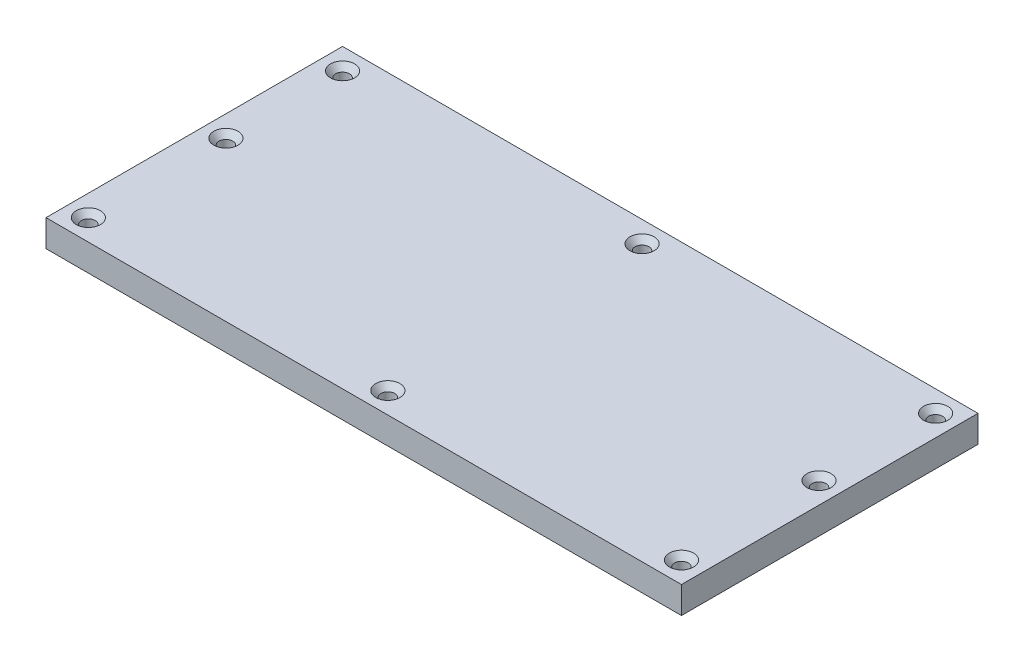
ISO-10303-21;
HEADER;
FILE_DESCRIPTION(('STEP AP214'),'2;1');
FILE_NAME('part.step','',(''),(''),'','','');
FILE_SCHEMA(('AUTOMOTIVE_DESIGN { 1 0 10303 214 1 1 1 1 }'));
ENDSEC;
DATA;
#1=APPLICATION_CONTEXT('core data for automotive mechanical design processes');
#2=APPLICATION_PROTOCOL_DEFINITION('international standard','automotive_design',2000,#1);
#3=PRODUCT_CONTEXT('',#1,'mechanical');
#4=PRODUCT('Part','Part','',(#3));
#5=PRODUCT_RELATED_PRODUCT_CATEGORY('part','',(#4));
#6=PRODUCT_DEFINITION_FORMATION('','',#4);
#7=PRODUCT_DEFINITION_CONTEXT('part definition',#1,'design');
#8=PRODUCT_DEFINITION('design','',#6,#7);
#9=PRODUCT_DEFINITION_SHAPE('','',#8);
#10=(LENGTH_UNIT() NAMED_UNIT(*) SI_UNIT(.MILLI.,.METRE.));
#11=(NAMED_UNIT(*) PLANE_ANGLE_UNIT() SI_UNIT($,.RADIAN.));
#12=(NAMED_UNIT(*) SI_UNIT($,.STERADIAN.) SOLID_ANGLE_UNIT());
#13=UNCERTAINTY_MEASURE_WITH_UNIT(LENGTH_MEASURE(1.E-05),#10,'distance_accuracy_value','');
#14=(GEOMETRIC_REPRESENTATION_CONTEXT(3) GLOBAL_UNCERTAINTY_ASSIGNED_CONTEXT((#13)) GLOBAL_UNIT_ASSIGNED_CONTEXT((#10,
#11,#12)) REPRESENTATION_CONTEXT('',''));
#15=CARTESIAN_POINT('',(0.,0.,0.));
#16=DIRECTION('',(0.,0.,1.));
#17=DIRECTION('',(1.,0.,0.));
#18=AXIS2_PLACEMENT_3D('',#15,#16,#17);
#19=CARTESIAN_POINT('',(-75.,6.35,35.));
#20=DIRECTION('',(1.,0.,0.));
#21=DIRECTION('',(0.,0.,-1.));
#22=AXIS2_PLACEMENT_3D('',#19,#20,#21);
#23=PLANE('',#22);
#24=DIRECTION('',(0.,0.,1.));
#25=VECTOR('',#24,1.);
#26=CARTESIAN_POINT('',(-75.,0.,35.));
#27=LINE('',#26,#25);
#28=CARTESIAN_POINT('',(-75.,0.,-35.));
#29=VERTEX_POINT('',#28);
#30=CARTESIAN_POINT('',(-75.,0.,35.));
#31=VERTEX_POINT('',#30);
#32=EDGE_CURVE('E107',#29,#31,#27,.T.);
#33=ORIENTED_EDGE('',*,*,#32,.T.);
#34=DIRECTION('',(0.,-1.,0.));
#35=VECTOR('',#34,1.);
#36=CARTESIAN_POINT('',(-75.,6.35,35.));
#37=LINE('',#36,#35);
#38=CARTESIAN_POINT('',(-75.,6.35,35.));
#39=VERTEX_POINT('',#38);
#40=EDGE_CURVE('E11',#39,#31,#37,.T.);
#41=ORIENTED_EDGE('',*,*,#40,.F.);
#42=DIRECTION('',(0.,0.,1.));
#43=VECTOR('',#42,1.);
#44=CARTESIAN_POINT('',(-75.,6.35,35.));
#45=LINE('',#44,#43);
#46=CARTESIAN_POINT('',(-75.,6.35,-35.));
#47=VERTEX_POINT('',#46);
#48=EDGE_CURVE('E91',#47,#39,#45,.T.);
#49=ORIENTED_EDGE('',*,*,#48,.F.);
#50=DIRECTION('',(0.,-1.,0.));
#51=VECTOR('',#50,1.);
#52=CARTESIAN_POINT('',(-75.,6.35,-35.));
#53=LINE('',#52,#51);
#54=EDGE_CURVE('E103',#47,#29,#53,.T.);
#55=ORIENTED_EDGE('',*,*,#54,.T.);
#56=EDGE_LOOP('',(#33,#41,#49,#55));
#57=FACE_BOUND('',#56,.T.);
#58=ADVANCED_FACE('F39',(#57),#23,.F.);
#59=CARTESIAN_POINT('',(75.,6.35,35.));
#60=DIRECTION('',(0.,0.,-1.));
#61=DIRECTION('',(-1.,0.,0.));
#62=AXIS2_PLACEMENT_3D('',#59,#60,#61);
#63=PLANE('',#62);
#64=DIRECTION('',(1.,0.,0.));
#65=VECTOR('',#64,1.);
#66=CARTESIAN_POINT('',(75.,0.,35.));
#67=LINE('',#66,#65);
#68=CARTESIAN_POINT('',(75.,0.,35.));
#69=VERTEX_POINT('',#68);
#70=EDGE_CURVE('E96',#31,#69,#67,.T.);
#71=ORIENTED_EDGE('',*,*,#70,.T.);
#72=DIRECTION('',(0.,-1.,0.));
#73=VECTOR('',#72,1.);
#74=CARTESIAN_POINT('',(75.,6.35,35.));
#75=LINE('',#74,#73);
#76=CARTESIAN_POINT('',(75.,6.35,35.));
#77=VERTEX_POINT('',#76);
#78=EDGE_CURVE('E48',#77,#69,#75,.T.);
#79=ORIENTED_EDGE('',*,*,#78,.F.);
#80=DIRECTION('',(1.,0.,0.));
#81=VECTOR('',#80,1.);
#82=CARTESIAN_POINT('',(75.,6.35,35.));
#83=LINE('',#82,#81);
#84=EDGE_CURVE('E86',#39,#77,#83,.T.);
#85=ORIENTED_EDGE('',*,*,#84,.F.);
#86=ORIENTED_EDGE('',*,*,#40,.T.);
#87=EDGE_LOOP('',(#71,#79,#85,#86));
#88=FACE_BOUND('',#87,.T.);
#89=ADVANCED_FACE('F95',(#88),#63,.F.);
#90=CARTESIAN_POINT('',(75.,6.35,35.));
#91=DIRECTION('',(-1.,0.,0.));
#92=DIRECTION('',(0.,0.,1.));
#93=AXIS2_PLACEMENT_3D('',#90,#91,#92);
#94=PLANE('',#93);
#95=DIRECTION('',(0.,0.,-1.));
#96=VECTOR('',#95,1.);
#97=CARTESIAN_POINT('',(75.,0.,35.));
#98=LINE('',#97,#96);
#99=CARTESIAN_POINT('',(75.,0.,-35.));
#100=VERTEX_POINT('',#99);
#101=EDGE_CURVE('E73',#69,#100,#98,.T.);
#102=ORIENTED_EDGE('',*,*,#101,.T.);
#103=DIRECTION('',(0.,-1.,0.));
#104=VECTOR('',#103,1.);
#105=CARTESIAN_POINT('',(75.,6.35,-35.));
#106=LINE('',#105,#104);
#107=CARTESIAN_POINT('',(75.,6.35,-35.));
#108=VERTEX_POINT('',#107);
#109=EDGE_CURVE('E98',#108,#100,#106,.T.);
#110=ORIENTED_EDGE('',*,*,#109,.F.);
#111=DIRECTION('',(0.,0.,-1.));
#112=VECTOR('',#111,1.);
#113=CARTESIAN_POINT('',(75.,6.35,35.));
#114=LINE('',#113,#112);
#115=EDGE_CURVE('E89',#77,#108,#114,.T.);
#116=ORIENTED_EDGE('',*,*,#115,.F.);
#117=ORIENTED_EDGE('',*,*,#78,.T.);
#118=EDGE_LOOP('',(#102,#110,#116,#117));
#119=FACE_BOUND('',#118,.T.);
#120=ADVANCED_FACE('F99',(#119),#94,.F.);
#121=CARTESIAN_POINT('',(75.,6.35,-35.));
#122=DIRECTION('',(0.,0.,1.));
#123=DIRECTION('',(1.,0.,0.));
#124=AXIS2_PLACEMENT_3D('',#121,#122,#123);
#125=PLANE('',#124);
#126=DIRECTION('',(-1.,0.,0.));
#127=VECTOR('',#126,1.);
#128=CARTESIAN_POINT('',(75.,0.,-35.));
#129=LINE('',#128,#127);
#130=EDGE_CURVE('E79',#100,#29,#129,.T.);
#131=ORIENTED_EDGE('',*,*,#130,.T.);
#132=ORIENTED_EDGE('',*,*,#54,.F.);
#133=DIRECTION('',(-1.,0.,0.));
#134=VECTOR('',#133,1.);
#135=CARTESIAN_POINT('',(75.,6.35,-35.));
#136=LINE('',#135,#134);
#137=EDGE_CURVE('E56',#108,#47,#136,.T.);
#138=ORIENTED_EDGE('',*,*,#137,.F.);
#139=ORIENTED_EDGE('',*,*,#109,.T.);
#140=EDGE_LOOP('',(#131,#132,#138,#139));
#141=FACE_BOUND('',#140,.T.);
#142=ADVANCED_FACE('F121',(#141),#125,.F.);
#143=CARTESIAN_POINT('',(0.,6.35,0.));
#144=DIRECTION('',(0.,1.,0.));
#145=DIRECTION('',(0.,0.,1.));
#146=AXIS2_PLACEMENT_3D('',#143,#144,#145);
#147=PLANE('',#146);
#148=CARTESIAN_POINT('',(-70.,6.35,-30.));
#149=DIRECTION('',(0.,1.,0.));
#150=DIRECTION('',(0.,0.,1.));
#151=AXIS2_PLACEMENT_3D('',#148,#149,#150);
#152=CIRCLE('',#151,2.8575);
#153=CARTESIAN_POINT('',(-70.,6.35,-27.1425));
#154=VERTEX_POINT('',#153);
#155=EDGE_CURVE('E219',#154,#154,#152,.T.);
#156=ORIENTED_EDGE('',*,*,#155,.F.);
#157=EDGE_LOOP('',(#156));
#158=FACE_BOUND('',#157,.T.);
#159=CARTESIAN_POINT('',(0.694282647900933,6.35,-30.));
#160=DIRECTION('',(0.,1.,0.));
#161=DIRECTION('',(0.,0.,1.));
#162=AXIS2_PLACEMENT_3D('',#159,#160,#161);
#163=CIRCLE('',#162,2.8575);
#164=CARTESIAN_POINT('',(0.694282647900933,6.35,-27.1425));
#165=VERTEX_POINT('',#164);
#166=EDGE_CURVE('E207',#165,#165,#163,.T.);
#167=ORIENTED_EDGE('',*,*,#166,.F.);
#168=EDGE_LOOP('',(#167));
#169=FACE_BOUND('',#168,.T.);
#170=CARTESIAN_POINT('',(70.,6.35,-30.));
#171=DIRECTION('',(0.,1.,0.));
#172=DIRECTION('',(0.,0.,1.));
#173=AXIS2_PLACEMENT_3D('',#170,#171,#172);
#174=CIRCLE('',#173,2.8575);
#175=CARTESIAN_POINT('',(70.,6.35,-27.1425));
#176=VERTEX_POINT('',#175);
#177=EDGE_CURVE('E195',#176,#176,#174,.T.);
#178=ORIENTED_EDGE('',*,*,#177,.F.);
#179=EDGE_LOOP('',(#178));
#180=FACE_BOUND('',#179,.T.);
#181=CARTESIAN_POINT('',(70.,6.35,-2.4696482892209));
#182=DIRECTION('',(0.,1.,0.));
#183=DIRECTION('',(0.,0.,1.));
#184=AXIS2_PLACEMENT_3D('',#181,#182,#183);
#185=CIRCLE('',#184,2.8575);
#186=CARTESIAN_POINT('',(70.,6.35,0.387851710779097));
#187=VERTEX_POINT('',#186);
#188=EDGE_CURVE('E183',#187,#187,#185,.T.);
#189=ORIENTED_EDGE('',*,*,#188,.F.);
#190=EDGE_LOOP('',(#189));
#191=FACE_BOUND('',#190,.T.);
#192=CARTESIAN_POINT('',(70.,6.35,30.));
#193=DIRECTION('',(0.,1.,0.));
#194=DIRECTION('',(0.,0.,1.));
#195=AXIS2_PLACEMENT_3D('',#192,#193,#194);
#196=CIRCLE('',#195,2.8575);
#197=CARTESIAN_POINT('',(70.,6.35,32.8575));
#198=VERTEX_POINT('',#197);
#199=EDGE_CURVE('E171',#198,#198,#196,.T.);
#200=ORIENTED_EDGE('',*,*,#199,.F.);
#201=EDGE_LOOP('',(#200));
#202=FACE_BOUND('',#201,.T.);
#203=CARTESIAN_POINT('',(0.694282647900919,6.35,30.));
#204=DIRECTION('',(0.,1.,0.));
#205=DIRECTION('',(0.,0.,1.));
#206=AXIS2_PLACEMENT_3D('',#203,#204,#205);
#207=CIRCLE('',#206,2.8575);
#208=CARTESIAN_POINT('',(0.694282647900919,6.35,32.8575));
#209=VERTEX_POINT('',#208);
#210=EDGE_CURVE('E159',#209,#209,#207,.T.);
#211=ORIENTED_EDGE('',*,*,#210,.F.);
#212=EDGE_LOOP('',(#211));
#213=FACE_BOUND('',#212,.T.);
#214=CARTESIAN_POINT('',(-70.,6.35,30.));
#215=DIRECTION('',(0.,1.,0.));
#216=DIRECTION('',(0.,0.,1.));
#217=AXIS2_PLACEMENT_3D('',#214,#215,#216);
#218=CIRCLE('',#217,2.8575);
#219=CARTESIAN_POINT('',(-70.,6.35,32.8575));
#220=VERTEX_POINT('',#219);
#221=EDGE_CURVE('E147',#220,#220,#218,.T.);
#222=ORIENTED_EDGE('',*,*,#221,.F.);
#223=EDGE_LOOP('',(#222));
#224=FACE_BOUND('',#223,.T.);
#225=CARTESIAN_POINT('',(-70.,6.35,-2.4696482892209));
#226=DIRECTION('',(0.,1.,0.));
#227=DIRECTION('',(0.,0.,1.));
#228=AXIS2_PLACEMENT_3D('',#225,#226,#227);
#229=CIRCLE('',#228,2.8575);
#230=CARTESIAN_POINT('',(-70.,6.35,0.387851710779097));
#231=VERTEX_POINT('',#230);
#232=EDGE_CURVE('E135',#231,#231,#229,.T.);
#233=ORIENTED_EDGE('',*,*,#232,.F.);
#234=EDGE_LOOP('',(#233));
#235=FACE_BOUND('',#234,.T.);
#236=ORIENTED_EDGE('',*,*,#48,.T.);
#237=ORIENTED_EDGE('',*,*,#84,.T.);
#238=ORIENTED_EDGE('',*,*,#115,.T.);
#239=ORIENTED_EDGE('',*,*,#137,.T.);
#240=EDGE_LOOP('',(#236,#237,#238,#239));
#241=FACE_BOUND('',#240,.T.);
#242=ADVANCED_FACE('F87',(#158,#169,#180,#191,#202,#213,#224,#235,#241),#147,.T.);
#243=CARTESIAN_POINT('',(0.,0.,0.));
#244=DIRECTION('',(0.,1.,0.));
#245=DIRECTION('',(0.,0.,1.));
#246=AXIS2_PLACEMENT_3D('',#243,#244,#245);
#247=PLANE('',#246);
#248=CARTESIAN_POINT('',(-70.,0.,-30.));
#249=DIRECTION('',(0.,1.,0.));
#250=DIRECTION('',(0.,0.,1.));
#251=AXIS2_PLACEMENT_3D('',#248,#249,#250);
#252=CIRCLE('',#251,1.63194999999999);
#253=CARTESIAN_POINT('',(-70.,0.,-28.36805));
#254=VERTEX_POINT('',#253);
#255=EDGE_CURVE('E211',#254,#254,#252,.T.);
#256=ORIENTED_EDGE('',*,*,#255,.T.);
#257=EDGE_LOOP('',(#256));
#258=FACE_BOUND('',#257,.T.);
#259=CARTESIAN_POINT('',(0.694282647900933,0.,-30.));
#260=DIRECTION('',(0.,1.,0.));
#261=DIRECTION('',(0.,0.,1.));
#262=AXIS2_PLACEMENT_3D('',#259,#260,#261);
#263=CIRCLE('',#262,1.63195);
#264=CARTESIAN_POINT('',(0.694282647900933,0.,-28.36805));
#265=VERTEX_POINT('',#264);
#266=EDGE_CURVE('E199',#265,#265,#263,.T.);
#267=ORIENTED_EDGE('',*,*,#266,.T.);
#268=EDGE_LOOP('',(#267));
#269=FACE_BOUND('',#268,.T.);
#270=CARTESIAN_POINT('',(70.,0.,-30.));
#271=DIRECTION('',(0.,1.,0.));
#272=DIRECTION('',(0.,0.,1.));
#273=AXIS2_PLACEMENT_3D('',#270,#271,#272);
#274=CIRCLE('',#273,1.63194999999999);
#275=CARTESIAN_POINT('',(70.,0.,-28.36805));
#276=VERTEX_POINT('',#275);
#277=EDGE_CURVE('E187',#276,#276,#274,.T.);
#278=ORIENTED_EDGE('',*,*,#277,.T.);
#279=EDGE_LOOP('',(#278));
#280=FACE_BOUND('',#279,.T.);
#281=CARTESIAN_POINT('',(70.,0.,-2.4696482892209));
#282=DIRECTION('',(0.,1.,0.));
#283=DIRECTION('',(0.,0.,1.));
#284=AXIS2_PLACEMENT_3D('',#281,#282,#283);
#285=CIRCLE('',#284,1.63194999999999);
#286=CARTESIAN_POINT('',(70.,0.,-0.837698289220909));
#287=VERTEX_POINT('',#286);
#288=EDGE_CURVE('E175',#287,#287,#285,.T.);
#289=ORIENTED_EDGE('',*,*,#288,.T.);
#290=EDGE_LOOP('',(#289));
#291=FACE_BOUND('',#290,.T.);
#292=CARTESIAN_POINT('',(70.,0.,30.));
#293=DIRECTION('',(0.,1.,0.));
#294=DIRECTION('',(0.,0.,1.));
#295=AXIS2_PLACEMENT_3D('',#292,#293,#294);
#296=CIRCLE('',#295,1.63194999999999);
#297=CARTESIAN_POINT('',(70.,0.,31.63195));
#298=VERTEX_POINT('',#297);
#299=EDGE_CURVE('E163',#298,#298,#296,.T.);
#300=ORIENTED_EDGE('',*,*,#299,.T.);
#301=EDGE_LOOP('',(#300));
#302=FACE_BOUND('',#301,.T.);
#303=CARTESIAN_POINT('',(0.694282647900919,0.,30.));
#304=DIRECTION('',(0.,1.,0.));
#305=DIRECTION('',(0.,0.,1.));
#306=AXIS2_PLACEMENT_3D('',#303,#304,#305);
#307=CIRCLE('',#306,1.63195);
#308=CARTESIAN_POINT('',(0.694282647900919,0.,31.63195));
#309=VERTEX_POINT('',#308);
#310=EDGE_CURVE('E151',#309,#309,#307,.T.);
#311=ORIENTED_EDGE('',*,*,#310,.T.);
#312=EDGE_LOOP('',(#311));
#313=FACE_BOUND('',#312,.T.);
#314=CARTESIAN_POINT('',(-70.,0.,30.));
#315=DIRECTION('',(0.,1.,0.));
#316=DIRECTION('',(0.,0.,1.));
#317=AXIS2_PLACEMENT_3D('',#314,#315,#316);
#318=CIRCLE('',#317,1.63194999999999);
#319=CARTESIAN_POINT('',(-70.,0.,31.63195));
#320=VERTEX_POINT('',#319);
#321=EDGE_CURVE('E139',#320,#320,#318,.T.);
#322=ORIENTED_EDGE('',*,*,#321,.T.);
#323=EDGE_LOOP('',(#322));
#324=FACE_BOUND('',#323,.T.);
#325=CARTESIAN_POINT('',(-70.,0.,-2.4696482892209));
#326=DIRECTION('',(0.,1.,0.));
#327=DIRECTION('',(0.,0.,1.));
#328=AXIS2_PLACEMENT_3D('',#325,#326,#327);
#329=CIRCLE('',#328,1.63194999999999);
#330=CARTESIAN_POINT('',(-70.,0.,-0.837698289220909));
#331=VERTEX_POINT('',#330);
#332=EDGE_CURVE('E111',#331,#331,#329,.T.);
#333=ORIENTED_EDGE('',*,*,#332,.T.);
#334=EDGE_LOOP('',(#333));
#335=FACE_BOUND('',#334,.T.);
#336=ORIENTED_EDGE('',*,*,#32,.F.);
#337=ORIENTED_EDGE('',*,*,#130,.F.);
#338=ORIENTED_EDGE('',*,*,#101,.F.);
#339=ORIENTED_EDGE('',*,*,#70,.F.);
#340=EDGE_LOOP('',(#336,#337,#338,#339));
#341=FACE_BOUND('',#340,.T.);
#342=ADVANCED_FACE('F124',(#258,#269,#280,#291,#302,#313,#324,#335,#341),#247,.F.);
#343=CARTESIAN_POINT('',(-70.,6.35,-2.4696482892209));
#344=DIRECTION('',(0.,1.,0.));
#345=DIRECTION('',(0.,0.,1.));
#346=AXIS2_PLACEMENT_3D('',#343,#344,#345);
#347=CYLINDRICAL_SURFACE('',#346,1.63194999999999);
#348=ORIENTED_EDGE('',*,*,#332,.F.);
#349=EDGE_LOOP('',(#348));
#350=FACE_BOUND('',#349,.T.);
#351=CARTESIAN_POINT('',(-70.,4.94016599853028,-2.4696482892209));
#352=DIRECTION('',(0.,1.,0.));
#353=DIRECTION('',(0.,0.,1.));
#354=AXIS2_PLACEMENT_3D('',#351,#352,#353);
#355=CIRCLE('',#354,1.63194999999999);
#356=CARTESIAN_POINT('',(-70.,4.94016599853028,-0.837698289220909));
#357=VERTEX_POINT('',#356);
#358=EDGE_CURVE('E131',#357,#357,#355,.T.);
#359=ORIENTED_EDGE('',*,*,#358,.T.);
#360=EDGE_LOOP('',(#359));
#361=FACE_BOUND('',#360,.T.);
#362=ADVANCED_FACE('F246',(#350,#361),#347,.F.);
#363=CARTESIAN_POINT('',(-70.,6.35,-2.4696482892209));
#364=DIRECTION('',(0.,1.,0.));
#365=DIRECTION('',(0.,0.,1.));
#366=AXIS2_PLACEMENT_3D('',#363,#364,#365);
#367=CONICAL_SURFACE('',#366,2.8575,0.715584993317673);
#368=ORIENTED_EDGE('',*,*,#358,.F.);
#369=EDGE_LOOP('',(#368));
#370=FACE_BOUND('',#369,.T.);
#371=ORIENTED_EDGE('',*,*,#232,.T.);
#372=EDGE_LOOP('',(#371));
#373=FACE_BOUND('',#372,.T.);
#374=ADVANCED_FACE('F243',(#370,#373),#367,.F.);
#375=CARTESIAN_POINT('',(-70.,6.35,30.));
#376=DIRECTION('',(0.,1.,0.));
#377=DIRECTION('',(0.,0.,1.));
#378=AXIS2_PLACEMENT_3D('',#375,#376,#377);
#379=CYLINDRICAL_SURFACE('',#378,1.63194999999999);
#380=ORIENTED_EDGE('',*,*,#321,.F.);
#381=EDGE_LOOP('',(#380));
#382=FACE_BOUND('',#381,.T.);
#383=CARTESIAN_POINT('',(-70.,4.94016599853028,30.));
#384=DIRECTION('',(0.,1.,0.));
#385=DIRECTION('',(0.,0.,1.));
#386=AXIS2_PLACEMENT_3D('',#383,#384,#385);
#387=CIRCLE('',#386,1.63194999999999);
#388=CARTESIAN_POINT('',(-70.,4.94016599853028,31.63195));
#389=VERTEX_POINT('',#388);
#390=EDGE_CURVE('E143',#389,#389,#387,.T.);
#391=ORIENTED_EDGE('',*,*,#390,.T.);
#392=EDGE_LOOP('',(#391));
#393=FACE_BOUND('',#392,.T.);
#394=ADVANCED_FACE('F245',(#382,#393),#379,.F.);
#395=CARTESIAN_POINT('',(-70.,6.35,30.));
#396=DIRECTION('',(0.,1.,0.));
#397=DIRECTION('',(0.,0.,1.));
#398=AXIS2_PLACEMENT_3D('',#395,#396,#397);
#399=CONICAL_SURFACE('',#398,2.8575,0.715584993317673);
#400=ORIENTED_EDGE('',*,*,#390,.F.);
#401=EDGE_LOOP('',(#400));
#402=FACE_BOUND('',#401,.T.);
#403=ORIENTED_EDGE('',*,*,#221,.T.);
#404=EDGE_LOOP('',(#403));
#405=FACE_BOUND('',#404,.T.);
#406=ADVANCED_FACE('F253',(#402,#405),#399,.F.);
#407=CARTESIAN_POINT('',(0.694282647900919,6.35,30.));
#408=DIRECTION('',(0.,1.,0.));
#409=DIRECTION('',(0.,0.,1.));
#410=AXIS2_PLACEMENT_3D('',#407,#408,#409);
#411=CYLINDRICAL_SURFACE('',#410,1.63195);
#412=ORIENTED_EDGE('',*,*,#310,.F.);
#413=EDGE_LOOP('',(#412));
#414=FACE_BOUND('',#413,.T.);
#415=CARTESIAN_POINT('',(0.694282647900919,4.94016599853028,30.));
#416=DIRECTION('',(0.,1.,0.));
#417=DIRECTION('',(0.,0.,1.));
#418=AXIS2_PLACEMENT_3D('',#415,#416,#417);
#419=CIRCLE('',#418,1.63194999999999);
#420=CARTESIAN_POINT('',(0.694282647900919,4.94016599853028,31.63195));
#421=VERTEX_POINT('',#420);
#422=EDGE_CURVE('E155',#421,#421,#419,.T.);
#423=ORIENTED_EDGE('',*,*,#422,.T.);
#424=EDGE_LOOP('',(#423));
#425=FACE_BOUND('',#424,.T.);
#426=ADVANCED_FACE('F295',(#414,#425),#411,.F.);
#427=CARTESIAN_POINT('',(0.694282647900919,6.35,30.));
#428=DIRECTION('',(0.,1.,0.));
#429=DIRECTION('',(0.,0.,1.));
#430=AXIS2_PLACEMENT_3D('',#427,#428,#429);
#431=CONICAL_SURFACE('',#430,2.8575,0.715584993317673);
#432=ORIENTED_EDGE('',*,*,#422,.F.);
#433=EDGE_LOOP('',(#432));
#434=FACE_BOUND('',#433,.T.);
#435=ORIENTED_EDGE('',*,*,#210,.T.);
#436=EDGE_LOOP('',(#435));
#437=FACE_BOUND('',#436,.T.);
#438=ADVANCED_FACE('F300',(#434,#437),#431,.F.);
#439=CARTESIAN_POINT('',(70.,6.35,30.));
#440=DIRECTION('',(0.,1.,0.));
#441=DIRECTION('',(0.,0.,1.));
#442=AXIS2_PLACEMENT_3D('',#439,#440,#441);
#443=CYLINDRICAL_SURFACE('',#442,1.63194999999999);
#444=ORIENTED_EDGE('',*,*,#299,.F.);
#445=EDGE_LOOP('',(#444));
#446=FACE_BOUND('',#445,.T.);
#447=CARTESIAN_POINT('',(70.,4.94016599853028,30.));
#448=DIRECTION('',(0.,1.,0.));
#449=DIRECTION('',(0.,0.,1.));
#450=AXIS2_PLACEMENT_3D('',#447,#448,#449);
#451=CIRCLE('',#450,1.63194999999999);
#452=CARTESIAN_POINT('',(70.,4.94016599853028,31.63195));
#453=VERTEX_POINT('',#452);
#454=EDGE_CURVE('E167',#453,#453,#451,.T.);
#455=ORIENTED_EDGE('',*,*,#454,.T.);
#456=EDGE_LOOP('',(#455));
#457=FACE_BOUND('',#456,.T.);
#458=ADVANCED_FACE('F306',(#446,#457),#443,.F.);
#459=CARTESIAN_POINT('',(70.,6.35,30.));
#460=DIRECTION('',(0.,1.,0.));
#461=DIRECTION('',(0.,0.,1.));
#462=AXIS2_PLACEMENT_3D('',#459,#460,#461);
#463=CONICAL_SURFACE('',#462,2.8575,0.715584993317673);
#464=ORIENTED_EDGE('',*,*,#454,.F.);
#465=EDGE_LOOP('',(#464));
#466=FACE_BOUND('',#465,.T.);
#467=ORIENTED_EDGE('',*,*,#199,.T.);
#468=EDGE_LOOP('',(#467));
#469=FACE_BOUND('',#468,.T.);
#470=ADVANCED_FACE('F310',(#466,#469),#463,.F.);
#471=CARTESIAN_POINT('',(70.,6.35,-2.4696482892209));
#472=DIRECTION('',(0.,1.,0.));
#473=DIRECTION('',(0.,0.,1.));
#474=AXIS2_PLACEMENT_3D('',#471,#472,#473);
#475=CYLINDRICAL_SURFACE('',#474,1.63194999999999);
#476=ORIENTED_EDGE('',*,*,#288,.F.);
#477=EDGE_LOOP('',(#476));
#478=FACE_BOUND('',#477,.T.);
#479=CARTESIAN_POINT('',(70.,4.94016599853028,-2.4696482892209));
#480=DIRECTION('',(0.,1.,0.));
#481=DIRECTION('',(0.,0.,1.));
#482=AXIS2_PLACEMENT_3D('',#479,#480,#481);
#483=CIRCLE('',#482,1.63194999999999);
#484=CARTESIAN_POINT('',(70.,4.94016599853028,-0.837698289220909));
#485=VERTEX_POINT('',#484);
#486=EDGE_CURVE('E179',#485,#485,#483,.T.);
#487=ORIENTED_EDGE('',*,*,#486,.T.);
#488=EDGE_LOOP('',(#487));
#489=FACE_BOUND('',#488,.T.);
#490=ADVANCED_FACE('F314',(#478,#489),#475,.F.);
#491=CARTESIAN_POINT('',(70.,6.35,-2.4696482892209));
#492=DIRECTION('',(0.,1.,0.));
#493=DIRECTION('',(0.,0.,1.));
#494=AXIS2_PLACEMENT_3D('',#491,#492,#493);
#495=CONICAL_SURFACE('',#494,2.8575,0.715584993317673);
#496=ORIENTED_EDGE('',*,*,#486,.F.);
#497=EDGE_LOOP('',(#496));
#498=FACE_BOUND('',#497,.T.);
#499=ORIENTED_EDGE('',*,*,#188,.T.);
#500=EDGE_LOOP('',(#499));
#501=FACE_BOUND('',#500,.T.);
#502=ADVANCED_FACE('F318',(#498,#501),#495,.F.);
#503=CARTESIAN_POINT('',(70.,6.35,-30.));
#504=DIRECTION('',(0.,1.,0.));
#505=DIRECTION('',(0.,0.,1.));
#506=AXIS2_PLACEMENT_3D('',#503,#504,#505);
#507=CYLINDRICAL_SURFACE('',#506,1.63194999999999);
#508=ORIENTED_EDGE('',*,*,#277,.F.);
#509=EDGE_LOOP('',(#508));
#510=FACE_BOUND('',#509,.T.);
#511=CARTESIAN_POINT('',(70.,4.94016599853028,-30.));
#512=DIRECTION('',(0.,1.,0.));
#513=DIRECTION('',(0.,0.,1.));
#514=AXIS2_PLACEMENT_3D('',#511,#512,#513);
#515=CIRCLE('',#514,1.63194999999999);
#516=CARTESIAN_POINT('',(70.,4.94016599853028,-28.36805));
#517=VERTEX_POINT('',#516);
#518=EDGE_CURVE('E191',#517,#517,#515,.T.);
#519=ORIENTED_EDGE('',*,*,#518,.T.);
#520=EDGE_LOOP('',(#519));
#521=FACE_BOUND('',#520,.T.);
#522=ADVANCED_FACE('F322',(#510,#521),#507,.F.);
#523=CARTESIAN_POINT('',(70.,6.35,-30.));
#524=DIRECTION('',(0.,1.,0.));
#525=DIRECTION('',(0.,0.,1.));
#526=AXIS2_PLACEMENT_3D('',#523,#524,#525);
#527=CONICAL_SURFACE('',#526,2.8575,0.715584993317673);
#528=ORIENTED_EDGE('',*,*,#518,.F.);
#529=EDGE_LOOP('',(#528));
#530=FACE_BOUND('',#529,.T.);
#531=ORIENTED_EDGE('',*,*,#177,.T.);
#532=EDGE_LOOP('',(#531));
#533=FACE_BOUND('',#532,.T.);
#534=ADVANCED_FACE('F326',(#530,#533),#527,.F.);
#535=CARTESIAN_POINT('',(0.694282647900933,6.35,-30.));
#536=DIRECTION('',(0.,1.,0.));
#537=DIRECTION('',(0.,0.,1.));
#538=AXIS2_PLACEMENT_3D('',#535,#536,#537);
#539=CYLINDRICAL_SURFACE('',#538,1.63195);
#540=ORIENTED_EDGE('',*,*,#266,.F.);
#541=EDGE_LOOP('',(#540));
#542=FACE_BOUND('',#541,.T.);
#543=CARTESIAN_POINT('',(0.694282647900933,4.94016599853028,-30.));
#544=DIRECTION('',(0.,1.,0.));
#545=DIRECTION('',(0.,0.,1.));
#546=AXIS2_PLACEMENT_3D('',#543,#544,#545);
#547=CIRCLE('',#546,1.63194999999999);
#548=CARTESIAN_POINT('',(0.694282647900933,4.94016599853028,-28.36805));
#549=VERTEX_POINT('',#548);
#550=EDGE_CURVE('E203',#549,#549,#547,.T.);
#551=ORIENTED_EDGE('',*,*,#550,.T.);
#552=EDGE_LOOP('',(#551));
#553=FACE_BOUND('',#552,.T.);
#554=ADVANCED_FACE('F330',(#542,#553),#539,.F.);
#555=CARTESIAN_POINT('',(0.694282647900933,6.35,-30.));
#556=DIRECTION('',(0.,1.,0.));
#557=DIRECTION('',(0.,0.,1.));
#558=AXIS2_PLACEMENT_3D('',#555,#556,#557);
#559=CONICAL_SURFACE('',#558,2.8575,0.715584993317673);
#560=ORIENTED_EDGE('',*,*,#550,.F.);
#561=EDGE_LOOP('',(#560));
#562=FACE_BOUND('',#561,.T.);
#563=ORIENTED_EDGE('',*,*,#166,.T.);
#564=EDGE_LOOP('',(#563));
#565=FACE_BOUND('',#564,.T.);
#566=ADVANCED_FACE('F334',(#562,#565),#559,.F.);
#567=CARTESIAN_POINT('',(-70.,6.35,-30.));
#568=DIRECTION('',(0.,1.,0.));
#569=DIRECTION('',(0.,0.,1.));
#570=AXIS2_PLACEMENT_3D('',#567,#568,#569);
#571=CYLINDRICAL_SURFACE('',#570,1.63194999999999);
#572=ORIENTED_EDGE('',*,*,#255,.F.);
#573=EDGE_LOOP('',(#572));
#574=FACE_BOUND('',#573,.T.);
#575=CARTESIAN_POINT('',(-70.,4.94016599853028,-30.));
#576=DIRECTION('',(0.,1.,0.));
#577=DIRECTION('',(0.,0.,1.));
#578=AXIS2_PLACEMENT_3D('',#575,#576,#577);
#579=CIRCLE('',#578,1.63194999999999);
#580=CARTESIAN_POINT('',(-70.,4.94016599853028,-28.36805));
#581=VERTEX_POINT('',#580);
#582=EDGE_CURVE('E215',#581,#581,#579,.T.);
#583=ORIENTED_EDGE('',*,*,#582,.T.);
#584=EDGE_LOOP('',(#583));
#585=FACE_BOUND('',#584,.T.);
#586=ADVANCED_FACE('F338',(#574,#585),#571,.F.);
#587=CARTESIAN_POINT('',(-70.,6.35,-30.));
#588=DIRECTION('',(0.,1.,0.));
#589=DIRECTION('',(0.,0.,1.));
#590=AXIS2_PLACEMENT_3D('',#587,#588,#589);
#591=CONICAL_SURFACE('',#590,2.8575,0.715584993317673);
#592=ORIENTED_EDGE('',*,*,#582,.F.);
#593=EDGE_LOOP('',(#592));
#594=FACE_BOUND('',#593,.T.);
#595=ORIENTED_EDGE('',*,*,#155,.T.);
#596=EDGE_LOOP('',(#595));
#597=FACE_BOUND('',#596,.T.);
#598=ADVANCED_FACE('F224',(#594,#597),#591,.F.);
#599=CLOSED_SHELL('',(#58,#89,#120,#142,#242,#342,#362,#374,#394,#406,#426,#438,#458,#470,#490,
#502,#522,#534,#554,#566,#586,#598));
#600=MANIFOLD_SOLID_BREP('B2',#599);
#601=ADVANCED_BREP_SHAPE_REPRESENTATION('',(#18,#600),#14);
#602=SHAPE_DEFINITION_REPRESENTATION(#9,#601);
ENDSEC;
END-ISO-10303-21;
